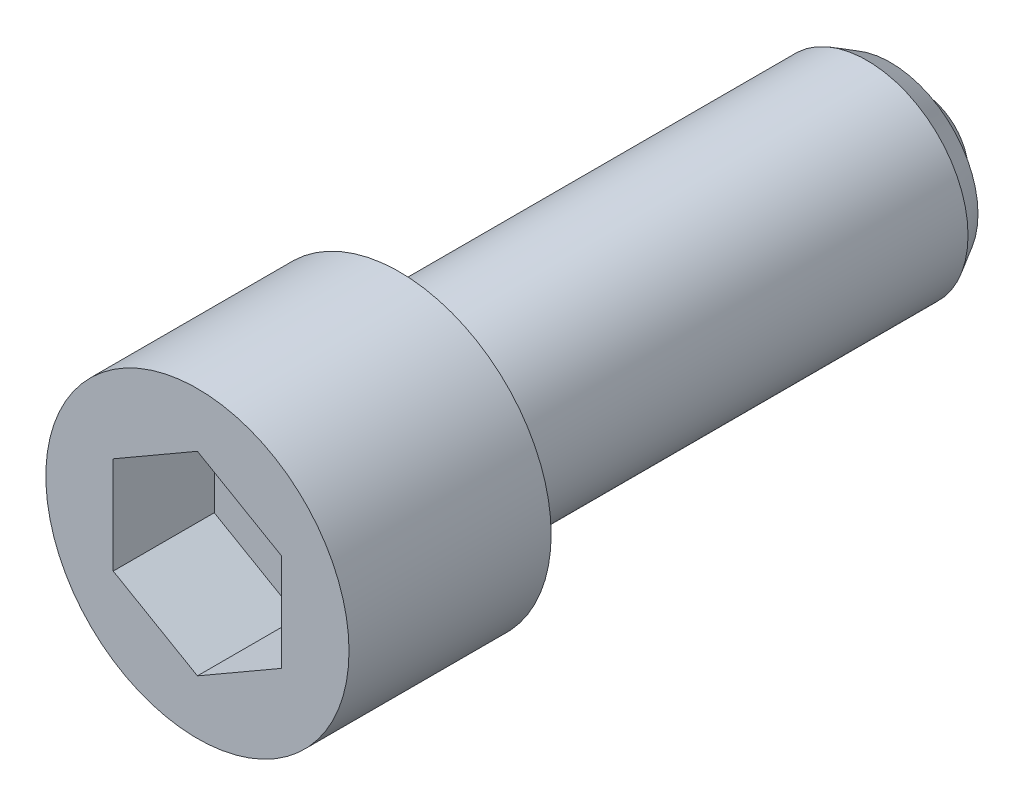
ISO-10303-21;
HEADER;
FILE_DESCRIPTION(('STEP AP214'),'2;1');
FILE_NAME('part.step','',(''),(''),'','','');
FILE_SCHEMA(('AUTOMOTIVE_DESIGN { 1 0 10303 214 1 1 1 1 }'));
ENDSEC;
DATA;
#1=APPLICATION_CONTEXT('core data for automotive mechanical design processes');
#2=APPLICATION_PROTOCOL_DEFINITION('international standard','automotive_design',2000,#1);
#3=PRODUCT_CONTEXT('',#1,'mechanical');
#4=PRODUCT('Part','Part','',(#3));
#5=PRODUCT_RELATED_PRODUCT_CATEGORY('part','',(#4));
#6=PRODUCT_DEFINITION_FORMATION('','',#4);
#7=PRODUCT_DEFINITION_CONTEXT('part definition',#1,'design');
#8=PRODUCT_DEFINITION('design','',#6,#7);
#9=PRODUCT_DEFINITION_SHAPE('','',#8);
#10=(LENGTH_UNIT() NAMED_UNIT(*) SI_UNIT(.MILLI.,.METRE.));
#11=(NAMED_UNIT(*) PLANE_ANGLE_UNIT() SI_UNIT($,.RADIAN.));
#12=(NAMED_UNIT(*) SI_UNIT($,.STERADIAN.) SOLID_ANGLE_UNIT());
#13=UNCERTAINTY_MEASURE_WITH_UNIT(LENGTH_MEASURE(1.E-05),#10,'distance_accuracy_value','');
#14=(GEOMETRIC_REPRESENTATION_CONTEXT(3) GLOBAL_UNCERTAINTY_ASSIGNED_CONTEXT((#13)) GLOBAL_UNIT_ASSIGNED_CONTEXT((#10,
#11,#12)) REPRESENTATION_CONTEXT('',''));
#15=CARTESIAN_POINT('',(0.,0.,0.));
#16=DIRECTION('',(0.,0.,1.));
#17=DIRECTION('',(1.,0.,0.));
#18=AXIS2_PLACEMENT_3D('',#15,#16,#17);
#19=CARTESIAN_POINT('',(0.,0.,4.35));
#20=DIRECTION('',(0.,0.,-1.));
#21=DIRECTION('',(1.,0.,0.));
#22=AXIS2_PLACEMENT_3D('',#19,#20,#21);
#23=SPHERICAL_SURFACE('',#22,4.35);
#24=CARTESIAN_POINT('',(0.,0.,2.85));
#25=DIRECTION('',(0.,0.,-1.));
#26=DIRECTION('',(1.,0.,0.));
#27=AXIS2_PLACEMENT_3D('',#24,#25,#26);
#28=CIRCLE('',#27,4.08319727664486);
#29=CARTESIAN_POINT('',(4.08319727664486,0.,2.85));
#30=VERTEX_POINT('',#29);
#31=EDGE_CURVE('E9',#30,#30,#28,.T.);
#32=ORIENTED_EDGE('',*,*,#31,.T.);
#33=EDGE_LOOP('',(#32));
#34=FACE_BOUND('',#33,.T.);
#35=ADVANCED_FACE('F14',(#34),#23,.T.);
#36=CARTESIAN_POINT('',(5.19170962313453,0.,2.85));
#37=DIRECTION('',(0.,0.,1.));
#38=DIRECTION('',(-1.,0.,0.));
#39=AXIS2_PLACEMENT_3D('',#36,#37,#38);
#40=PLANE('',#39);
#41=ORIENTED_EDGE('',*,*,#31,.F.);
#42=EDGE_LOOP('',(#41));
#43=FACE_BOUND('',#42,.T.);
#44=CARTESIAN_POINT('',(0.,0.,2.85));
#45=DIRECTION('',(0.,0.,-1.));
#46=DIRECTION('',(1.,0.,0.));
#47=AXIS2_PLACEMENT_3D('',#44,#45,#46);
#48=CIRCLE('',#47,5.19170962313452);
#49=CARTESIAN_POINT('',(5.19170962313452,0.,2.85));
#50=VERTEX_POINT('',#49);
#51=EDGE_CURVE('E21',#50,#50,#48,.T.);
#52=ORIENTED_EDGE('',*,*,#51,.T.);
#53=EDGE_LOOP('',(#52));
#54=FACE_BOUND('',#53,.T.);
#55=ADVANCED_FACE('F135',(#43,#54),#40,.F.);
#56=CARTESIAN_POINT('',(0.,0.,4.25));
#57=DIRECTION('',(0.,0.,1.));
#58=DIRECTION('',(-1.,0.,0.));
#59=AXIS2_PLACEMENT_3D('',#56,#57,#58);
#60=CONICAL_SURFACE('',#59,6.,0.523598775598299);
#61=ORIENTED_EDGE('',*,*,#51,.F.);
#62=EDGE_LOOP('',(#61));
#63=FACE_BOUND('',#62,.T.);
#64=CARTESIAN_POINT('',(0.,0.,4.25));
#65=DIRECTION('',(0.,0.,-1.));
#66=DIRECTION('',(1.,0.,0.));
#67=AXIS2_PLACEMENT_3D('',#64,#65,#66);
#68=CIRCLE('',#67,6.);
#69=CARTESIAN_POINT('',(6.,0.,4.25));
#70=VERTEX_POINT('',#69);
#71=EDGE_CURVE('E130',#70,#70,#68,.T.);
#72=ORIENTED_EDGE('',*,*,#71,.T.);
#73=EDGE_LOOP('',(#72));
#74=FACE_BOUND('',#73,.T.);
#75=ADVANCED_FACE('F137',(#63,#74),#60,.T.);
#76=CARTESIAN_POINT('',(0.,0.,-18.));
#77=DIRECTION('',(0.,0.,-1.));
#78=DIRECTION('',(1.,0.,0.));
#79=AXIS2_PLACEMENT_3D('',#76,#77,#78);
#80=CYLINDRICAL_SURFACE('',#79,6.);
#81=CARTESIAN_POINT('',(0.,0.,32.));
#82=DIRECTION('',(0.,0.,-1.));
#83=DIRECTION('',(1.,0.,0.));
#84=AXIS2_PLACEMENT_3D('',#81,#82,#83);
#85=CIRCLE('',#84,6.);
#86=CARTESIAN_POINT('',(6.,0.,32.));
#87=VERTEX_POINT('',#86);
#88=EDGE_CURVE('E127',#87,#87,#85,.T.);
#89=ORIENTED_EDGE('',*,*,#88,.T.);
#90=EDGE_LOOP('',(#89));
#91=FACE_BOUND('',#90,.T.);
#92=ORIENTED_EDGE('',*,*,#71,.F.);
#93=EDGE_LOOP('',(#92));
#94=FACE_BOUND('',#93,.T.);
#95=ADVANCED_FACE('F140',(#91,#94),#80,.T.);
#96=CARTESIAN_POINT('',(6.,0.,32.));
#97=DIRECTION('',(0.,0.,-1.));
#98=DIRECTION('',(1.,0.,0.));
#99=AXIS2_PLACEMENT_3D('',#96,#97,#98);
#100=PLANE('',#99);
#101=CARTESIAN_POINT('',(0.,0.,32.));
#102=DIRECTION('',(0.,0.,-1.));
#103=DIRECTION('',(1.,0.,0.));
#104=AXIS2_PLACEMENT_3D('',#101,#102,#103);
#105=CIRCLE('',#104,9.);
#106=CARTESIAN_POINT('',(9.00000000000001,0.,32.));
#107=VERTEX_POINT('',#106);
#108=EDGE_CURVE('E124',#107,#107,#105,.T.);
#109=ORIENTED_EDGE('',*,*,#108,.T.);
#110=EDGE_LOOP('',(#109));
#111=FACE_BOUND('',#110,.T.);
#112=ORIENTED_EDGE('',*,*,#88,.F.);
#113=EDGE_LOOP('',(#112));
#114=FACE_BOUND('',#113,.T.);
#115=ADVANCED_FACE('F145',(#111,#114),#100,.T.);
#116=CARTESIAN_POINT('',(0.,0.,-18.));
#117=DIRECTION('',(0.,0.,-1.));
#118=DIRECTION('',(1.,0.,0.));
#119=AXIS2_PLACEMENT_3D('',#116,#117,#118);
#120=CYLINDRICAL_SURFACE('',#119,9.);
#121=CARTESIAN_POINT('',(0.,0.,44.));
#122=DIRECTION('',(0.,0.,-1.));
#123=DIRECTION('',(1.,0.,0.));
#124=AXIS2_PLACEMENT_3D('',#121,#122,#123);
#125=CIRCLE('',#124,9.);
#126=CARTESIAN_POINT('',(9.00000000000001,0.,44.));
#127=VERTEX_POINT('',#126);
#128=EDGE_CURVE('E121',#127,#127,#125,.T.);
#129=ORIENTED_EDGE('',*,*,#128,.T.);
#130=EDGE_LOOP('',(#129));
#131=FACE_BOUND('',#130,.T.);
#132=ORIENTED_EDGE('',*,*,#108,.F.);
#133=EDGE_LOOP('',(#132));
#134=FACE_BOUND('',#133,.T.);
#135=ADVANCED_FACE('F152',(#131,#134),#120,.T.);
#136=CARTESIAN_POINT('',(9.,0.,44.));
#137=DIRECTION('',(0.,0.,1.));
#138=DIRECTION('',(-1.,0.,0.));
#139=AXIS2_PLACEMENT_3D('',#136,#137,#138);
#140=PLANE('',#139);
#141=DIRECTION('',(-0.86602540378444,0.5,0.));
#142=VECTOR('',#141,1.);
#143=CARTESIAN_POINT('',(5.,2.88675134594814,44.));
#144=LINE('',#143,#142);
#145=CARTESIAN_POINT('',(5.,2.88675134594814,44.));
#146=VERTEX_POINT('',#145);
#147=CARTESIAN_POINT('',(0.,5.77350269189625,44.));
#148=VERTEX_POINT('',#147);
#149=EDGE_CURVE('E28',#146,#148,#144,.T.);
#150=ORIENTED_EDGE('',*,*,#149,.F.);
#151=DIRECTION('',(0.,1.,0.));
#152=VECTOR('',#151,1.);
#153=CARTESIAN_POINT('',(5.,-2.88675134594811,44.));
#154=LINE('',#153,#152);
#155=CARTESIAN_POINT('',(5.,-2.88675134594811,44.));
#156=VERTEX_POINT('',#155);
#157=EDGE_CURVE('E97',#156,#146,#154,.T.);
#158=ORIENTED_EDGE('',*,*,#157,.F.);
#159=DIRECTION('',(-0.866025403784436,-0.5,0.));
#160=VECTOR('',#159,1.);
#161=CARTESIAN_POINT('',(5.,-2.88675134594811,44.));
#162=LINE('',#161,#160);
#163=CARTESIAN_POINT('',(0.,-5.77350269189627,44.));
#164=VERTEX_POINT('',#163);
#165=EDGE_CURVE('E92',#156,#164,#162,.T.);
#166=ORIENTED_EDGE('',*,*,#165,.T.);
#167=DIRECTION('',(0.866025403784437,-0.5,0.));
#168=VECTOR('',#167,1.);
#169=CARTESIAN_POINT('',(-5.,-2.88675134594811,44.));
#170=LINE('',#169,#168);
#171=CARTESIAN_POINT('',(-5.,-2.88675134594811,44.));
#172=VERTEX_POINT('',#171);
#173=EDGE_CURVE('E90',#172,#164,#170,.T.);
#174=ORIENTED_EDGE('',*,*,#173,.F.);
#175=DIRECTION('',(0.,1.,0.));
#176=VECTOR('',#175,1.);
#177=CARTESIAN_POINT('',(-5.,-2.88675134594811,44.));
#178=LINE('',#177,#176);
#179=CARTESIAN_POINT('',(-5.,2.88675134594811,44.));
#180=VERTEX_POINT('',#179);
#181=EDGE_CURVE('E71',#172,#180,#178,.T.);
#182=ORIENTED_EDGE('',*,*,#181,.T.);
#183=DIRECTION('',(0.866025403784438,0.5,0.));
#184=VECTOR('',#183,1.);
#185=CARTESIAN_POINT('',(-5.,2.88675134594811,44.));
#186=LINE('',#185,#184);
#187=EDGE_CURVE('E82',#180,#148,#186,.T.);
#188=ORIENTED_EDGE('',*,*,#187,.T.);
#189=EDGE_LOOP('',(#150,#158,#166,#174,#182,#188));
#190=FACE_BOUND('',#189,.T.);
#191=ORIENTED_EDGE('',*,*,#128,.F.);
#192=EDGE_LOOP('',(#191));
#193=FACE_BOUND('',#192,.T.);
#194=ADVANCED_FACE('F86',(#190,#193),#140,.T.);
#195=CARTESIAN_POINT('',(5.,2.88675134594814,38.));
#196=DIRECTION('',(0.5,0.86602540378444,0.));
#197=DIRECTION('',(0.86602540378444,-0.5,0.));
#198=AXIS2_PLACEMENT_3D('',#195,#196,#197);
#199=PLANE('',#198);
#200=DIRECTION('',(0.,0.,1.));
#201=VECTOR('',#200,1.);
#202=CARTESIAN_POINT('',(5.,2.88675134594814,38.));
#203=LINE('',#202,#201);
#204=CARTESIAN_POINT('',(5.,2.88675134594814,38.));
#205=VERTEX_POINT('',#204);
#206=EDGE_CURVE('E35',#205,#146,#203,.T.);
#207=ORIENTED_EDGE('',*,*,#206,.T.);
#208=ORIENTED_EDGE('',*,*,#149,.T.);
#209=DIRECTION('',(0.,0.,1.));
#210=VECTOR('',#209,1.);
#211=CARTESIAN_POINT('',(0.,5.77350269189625,38.));
#212=LINE('',#211,#210);
#213=CARTESIAN_POINT('',(0.,5.77350269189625,38.));
#214=VERTEX_POINT('',#213);
#215=EDGE_CURVE('E79',#214,#148,#212,.T.);
#216=ORIENTED_EDGE('',*,*,#215,.F.);
#217=DIRECTION('',(-0.86602540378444,0.5,0.));
#218=VECTOR('',#217,1.);
#219=CARTESIAN_POINT('',(5.,2.88675134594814,38.));
#220=LINE('',#219,#218);
#221=EDGE_CURVE('E99',#205,#214,#220,.T.);
#222=ORIENTED_EDGE('',*,*,#221,.F.);
#223=EDGE_LOOP('',(#207,#208,#216,#222));
#224=FACE_BOUND('',#223,.T.);
#225=ADVANCED_FACE('F204',(#224),#199,.F.);
#226=CARTESIAN_POINT('',(5.,-2.88675134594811,38.));
#227=DIRECTION('',(1.,0.,0.));
#228=DIRECTION('',(0.,-1.,0.));
#229=AXIS2_PLACEMENT_3D('',#226,#227,#228);
#230=PLANE('',#229);
#231=DIRECTION('',(0.,0.,1.));
#232=VECTOR('',#231,1.);
#233=CARTESIAN_POINT('',(5.,-2.88675134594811,38.));
#234=LINE('',#233,#232);
#235=CARTESIAN_POINT('',(5.,-2.88675134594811,38.));
#236=VERTEX_POINT('',#235);
#237=EDGE_CURVE('E118',#236,#156,#234,.T.);
#238=ORIENTED_EDGE('',*,*,#237,.T.);
#239=ORIENTED_EDGE('',*,*,#157,.T.);
#240=ORIENTED_EDGE('',*,*,#206,.F.);
#241=DIRECTION('',(0.,1.,0.));
#242=VECTOR('',#241,1.);
#243=CARTESIAN_POINT('',(5.,-2.88675134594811,38.));
#244=LINE('',#243,#242);
#245=EDGE_CURVE('E111',#236,#205,#244,.T.);
#246=ORIENTED_EDGE('',*,*,#245,.F.);
#247=EDGE_LOOP('',(#238,#239,#240,#246));
#248=FACE_BOUND('',#247,.T.);
#249=ADVANCED_FACE('F213',(#248),#230,.F.);
#250=CARTESIAN_POINT('',(5.,-2.88675134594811,38.));
#251=DIRECTION('',(-0.5,0.866025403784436,0.));
#252=DIRECTION('',(0.866025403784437,0.5,0.));
#253=AXIS2_PLACEMENT_3D('',#250,#251,#252);
#254=PLANE('',#253);
#255=DIRECTION('',(0.,0.,1.));
#256=VECTOR('',#255,1.);
#257=CARTESIAN_POINT('',(0.,-5.77350269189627,38.));
#258=LINE('',#257,#256);
#259=CARTESIAN_POINT('',(0.,-5.77350269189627,38.));
#260=VERTEX_POINT('',#259);
#261=EDGE_CURVE('E116',#260,#164,#258,.T.);
#262=ORIENTED_EDGE('',*,*,#261,.T.);
#263=ORIENTED_EDGE('',*,*,#165,.F.);
#264=ORIENTED_EDGE('',*,*,#237,.F.);
#265=DIRECTION('',(-0.866025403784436,-0.5,0.));
#266=VECTOR('',#265,1.);
#267=CARTESIAN_POINT('',(5.,-2.88675134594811,38.));
#268=LINE('',#267,#266);
#269=EDGE_CURVE('E108',#236,#260,#268,.T.);
#270=ORIENTED_EDGE('',*,*,#269,.T.);
#271=EDGE_LOOP('',(#262,#263,#264,#270));
#272=FACE_BOUND('',#271,.T.);
#273=ADVANCED_FACE('F222',(#272),#254,.T.);
#274=CARTESIAN_POINT('',(-5.,-2.88675134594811,38.));
#275=DIRECTION('',(-0.5,-0.866025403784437,0.));
#276=DIRECTION('',(-0.866025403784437,0.5,0.));
#277=AXIS2_PLACEMENT_3D('',#274,#275,#276);
#278=PLANE('',#277);
#279=DIRECTION('',(0.,0.,1.));
#280=VECTOR('',#279,1.);
#281=CARTESIAN_POINT('',(-5.,-2.88675134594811,38.));
#282=LINE('',#281,#280);
#283=CARTESIAN_POINT('',(-5.,-2.88675134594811,38.));
#284=VERTEX_POINT('',#283);
#285=EDGE_CURVE('E78',#284,#172,#282,.T.);
#286=ORIENTED_EDGE('',*,*,#285,.T.);
#287=ORIENTED_EDGE('',*,*,#173,.T.);
#288=ORIENTED_EDGE('',*,*,#261,.F.);
#289=DIRECTION('',(0.866025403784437,-0.5,0.));
#290=VECTOR('',#289,1.);
#291=CARTESIAN_POINT('',(-5.,-2.88675134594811,38.));
#292=LINE('',#291,#290);
#293=EDGE_CURVE('E105',#284,#260,#292,.T.);
#294=ORIENTED_EDGE('',*,*,#293,.F.);
#295=EDGE_LOOP('',(#286,#287,#288,#294));
#296=FACE_BOUND('',#295,.T.);
#297=ADVANCED_FACE('F231',(#296),#278,.F.);
#298=CARTESIAN_POINT('',(-5.,-2.88675134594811,38.));
#299=DIRECTION('',(1.,0.,0.));
#300=DIRECTION('',(0.,-1.,0.));
#301=AXIS2_PLACEMENT_3D('',#298,#299,#300);
#302=PLANE('',#301);
#303=DIRECTION('',(0.,0.,1.));
#304=VECTOR('',#303,1.);
#305=CARTESIAN_POINT('',(-5.,2.88675134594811,38.));
#306=LINE('',#305,#304);
#307=CARTESIAN_POINT('',(-5.,2.88675134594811,38.));
#308=VERTEX_POINT('',#307);
#309=EDGE_CURVE('E67',#308,#180,#306,.T.);
#310=ORIENTED_EDGE('',*,*,#309,.T.);
#311=ORIENTED_EDGE('',*,*,#181,.F.);
#312=ORIENTED_EDGE('',*,*,#285,.F.);
#313=DIRECTION('',(0.,1.,0.));
#314=VECTOR('',#313,1.);
#315=CARTESIAN_POINT('',(-5.,-2.88675134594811,38.));
#316=LINE('',#315,#314);
#317=EDGE_CURVE('E74',#284,#308,#316,.T.);
#318=ORIENTED_EDGE('',*,*,#317,.T.);
#319=EDGE_LOOP('',(#310,#311,#312,#318));
#320=FACE_BOUND('',#319,.T.);
#321=ADVANCED_FACE('F69',(#320),#302,.T.);
#322=CARTESIAN_POINT('',(-5.,2.88675134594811,38.));
#323=DIRECTION('',(0.5,-0.866025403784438,0.));
#324=DIRECTION('',(-0.866025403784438,-0.5,0.));
#325=AXIS2_PLACEMENT_3D('',#322,#323,#324);
#326=PLANE('',#325);
#327=DIRECTION('',(0.866025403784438,0.5,0.));
#328=VECTOR('',#327,1.);
#329=CARTESIAN_POINT('',(-5.,2.88675134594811,38.));
#330=LINE('',#329,#328);
#331=EDGE_CURVE('E102',#308,#214,#330,.T.);
#332=ORIENTED_EDGE('',*,*,#331,.T.);
#333=ORIENTED_EDGE('',*,*,#215,.T.);
#334=ORIENTED_EDGE('',*,*,#187,.F.);
#335=ORIENTED_EDGE('',*,*,#309,.F.);
#336=EDGE_LOOP('',(#332,#333,#334,#335));
#337=FACE_BOUND('',#336,.T.);
#338=ADVANCED_FACE('F83',(#337),#326,.T.);
#339=CARTESIAN_POINT('',(-5.,8.66025403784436,38.));
#340=DIRECTION('',(0.,0.,-1.));
#341=DIRECTION('',(1.,0.,0.));
#342=AXIS2_PLACEMENT_3D('',#339,#340,#341);
#343=PLANE('',#342);
#344=ORIENTED_EDGE('',*,*,#221,.T.);
#345=ORIENTED_EDGE('',*,*,#331,.F.);
#346=ORIENTED_EDGE('',*,*,#317,.F.);
#347=ORIENTED_EDGE('',*,*,#293,.T.);
#348=ORIENTED_EDGE('',*,*,#269,.F.);
#349=ORIENTED_EDGE('',*,*,#245,.T.);
#350=EDGE_LOOP('',(#344,#345,#346,#347,#348,#349));
#351=FACE_BOUND('',#350,.T.);
#352=ADVANCED_FACE('F251',(#351),#343,.F.);
#353=CLOSED_SHELL('',(#35,#55,#75,#95,#115,#135,#194,#225,#249,#273,#297,#321,#338,#352));
#354=MANIFOLD_SOLID_BREP('B1',#353);
#355=ADVANCED_BREP_SHAPE_REPRESENTATION('',(#18,#354),#14);
#356=SHAPE_DEFINITION_REPRESENTATION(#9,#355);
ENDSEC;
END-ISO-10303-21;
